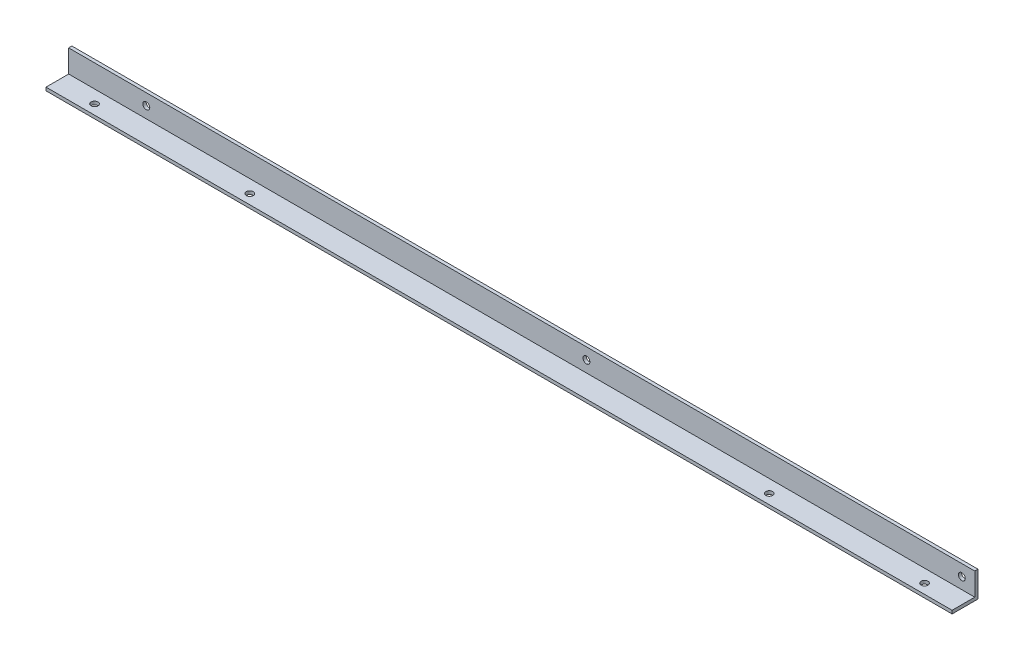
from build123d import *

# Parameters (mm, degrees)
SKETCH1_W           = 889
SKETCH1_H           = 25.4
BOSS_EXTRUDE1_DEPTH = 3.175
SKETCH2_W           = 889
SKETCH2_H           = 3.175
BOSS_EXTRUDE2_DEPTH = 22.225
SKETCH3_R           = 3.3782
CUT_EXTRUDE1_DEPTH  = 446.236443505
SKETCH4_R           = 3.3782
CUT_EXTRUDE2_DEPTH  = 446.779497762


with BuildPart() as part:
    # Sketch1 → Boss-Extrude1 (new body)
    with BuildSketch(Plane(origin=(0, 0, 0), x_dir=(1, 0, 0), z_dir=(0, 1, 0))):
        Rectangle(SKETCH1_W, SKETCH1_H)
    extrude(amount=BOSS_EXTRUDE1_DEPTH)

    # Sketch2 → Boss-Extrude2 (add)
    with BuildSketch(Plane(origin=(0, 3.175, 0), x_dir=(1, 0, 0), z_dir=(0, 1, 0))):
        with Locations((0, 11.1125)):
            Rectangle(SKETCH2_W, SKETCH2_H)
    extrude(amount=BOSS_EXTRUDE2_DEPTH)

    # Sketch3 → Cut-Extrude1 (cut, through all)
    with BuildSketch(Plane(origin=(0, 3.175, 0), x_dir=(1, 0, 0), z_dir=(0, 1, 0))):
        with Locations(Location((-406.4, -3.175, 0), (0, 0, 270))):
            Circle(SKETCH3_R)
        with Locations(Location((-254, -3.175, 0), (0, 0, 270))):
            Circle(SKETCH3_R)
        with Locations(Location((407.9875, -3.175, 0), (0, 0, 270))):
            Circle(SKETCH3_R)
        with Locations(Location((255.5875, -3.175, 0), (0, 0, 270))):
            Circle(SKETCH3_R)
    extrude(amount=-CUT_EXTRUDE1_DEPTH, mode=Mode.SUBTRACT)

    # Sketch4 → Cut-Extrude2 (cut, through all)
    with BuildSketch(Plane.XY.offset(-9.525)):
        with Locations((431.8, 14.2875)):
            Circle(SKETCH4_R)
        with Locations((63.5, 14.2875)):
            Circle(SKETCH4_R)
        with Locations((-368.3, 14.2875)):
            Circle(SKETCH4_R)
    extrude(amount=-CUT_EXTRUDE2_DEPTH, mode=Mode.SUBTRACT)


solid = part.part
